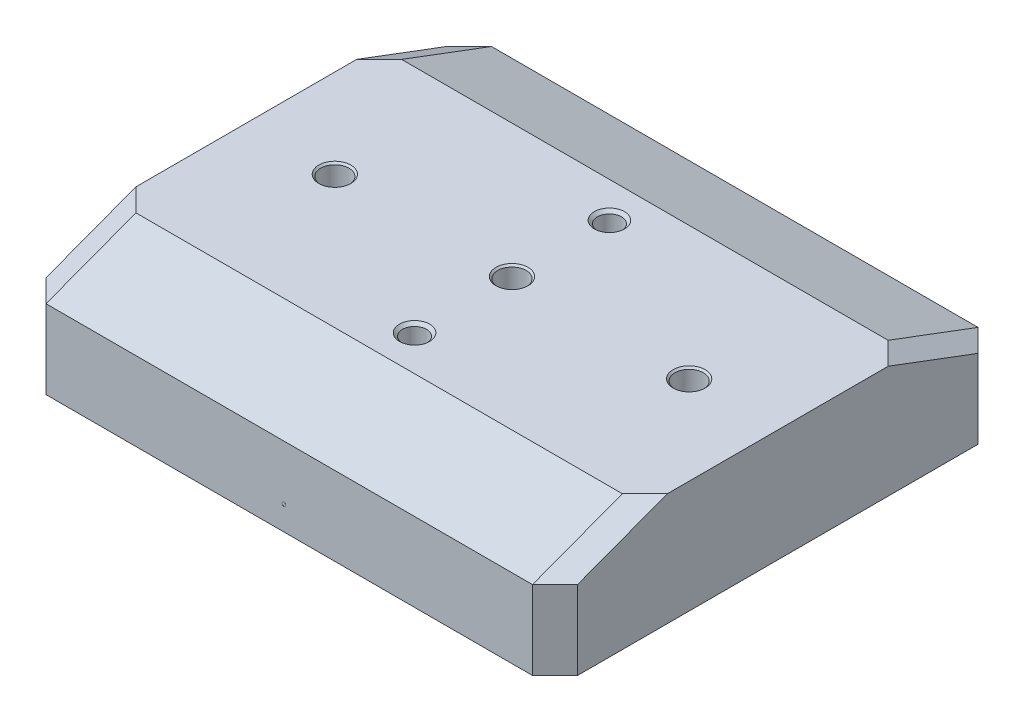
ISO-10303-21;
HEADER;
FILE_DESCRIPTION(('STEP AP214'),'2;1');
FILE_NAME('part.step','',(''),(''),'','','');
FILE_SCHEMA(('AUTOMOTIVE_DESIGN { 1 0 10303 214 1 1 1 1 }'));
ENDSEC;
DATA;
#1=APPLICATION_CONTEXT('core data for automotive mechanical design processes');
#2=APPLICATION_PROTOCOL_DEFINITION('international standard','automotive_design',2000,#1);
#3=PRODUCT_CONTEXT('',#1,'mechanical');
#4=PRODUCT('Part','Part','',(#3));
#5=PRODUCT_RELATED_PRODUCT_CATEGORY('part','',(#4));
#6=PRODUCT_DEFINITION_FORMATION('','',#4);
#7=PRODUCT_DEFINITION_CONTEXT('part definition',#1,'design');
#8=PRODUCT_DEFINITION('design','',#6,#7);
#9=PRODUCT_DEFINITION_SHAPE('','',#8);
#10=(LENGTH_UNIT() NAMED_UNIT(*) SI_UNIT(.MILLI.,.METRE.));
#11=(NAMED_UNIT(*) PLANE_ANGLE_UNIT() SI_UNIT($,.RADIAN.));
#12=(NAMED_UNIT(*) SI_UNIT($,.STERADIAN.) SOLID_ANGLE_UNIT());
#13=UNCERTAINTY_MEASURE_WITH_UNIT(LENGTH_MEASURE(1.E-05),#10,'distance_accuracy_value','');
#14=(GEOMETRIC_REPRESENTATION_CONTEXT(3) GLOBAL_UNCERTAINTY_ASSIGNED_CONTEXT((#13)) GLOBAL_UNIT_ASSIGNED_CONTEXT((#10,
#11,#12)) REPRESENTATION_CONTEXT('',''));
#15=CARTESIAN_POINT('',(0.,0.,0.));
#16=DIRECTION('',(0.,0.,1.));
#17=DIRECTION('',(1.,0.,0.));
#18=AXIS2_PLACEMENT_3D('',#15,#16,#17);
#19=CARTESIAN_POINT('',(75.,31.75,-62.865));
#20=DIRECTION('',(-1.,0.,0.));
#21=DIRECTION('',(0.,0.,1.));
#22=AXIS2_PLACEMENT_3D('',#19,#20,#21);
#23=PLANE('',#22);
#24=DIRECTION('',(0.,1.,0.));
#25=VECTOR('',#24,1.);
#26=CARTESIAN_POINT('',(75.,31.75,-56.515));
#27=LINE('',#26,#25);
#28=CARTESIAN_POINT('',(75.,0.,-56.515));
#29=VERTEX_POINT('',#28);
#30=CARTESIAN_POINT('',(75.,22.225,-56.515));
#31=VERTEX_POINT('',#30);
#32=EDGE_CURVE('E154',#29,#31,#27,.T.);
#33=ORIENTED_EDGE('',*,*,#32,.T.);
#34=DIRECTION('',(0.,0.351548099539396,0.936169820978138));
#35=VECTOR('',#34,1.);
#36=CARTESIAN_POINT('',(75.,21.3123169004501,-58.9454679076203));
#37=LINE('',#36,#35);
#38=CARTESIAN_POINT('',(75.,31.75,-31.15));
#39=VERTEX_POINT('',#38);
#40=EDGE_CURVE('E30',#31,#39,#37,.T.);
#41=ORIENTED_EDGE('',*,*,#40,.T.);
#42=DIRECTION('',(0.,0.,-1.));
#43=VECTOR('',#42,1.);
#44=CARTESIAN_POINT('',(75.,31.75,-62.865));
#45=LINE('',#44,#43);
#46=CARTESIAN_POINT('',(75.,31.75,31.15));
#47=VERTEX_POINT('',#46);
#48=EDGE_CURVE('E216',#47,#39,#45,.T.);
#49=ORIENTED_EDGE('',*,*,#48,.F.);
#50=DIRECTION('',(0.,-0.351548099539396,0.936169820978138));
#51=VECTOR('',#50,1.);
#52=CARTESIAN_POINT('',(75.,62.6911564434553,-51.2460559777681));
#53=LINE('',#52,#51);
#54=CARTESIAN_POINT('',(75.,22.225,56.515));
#55=VERTEX_POINT('',#54);
#56=EDGE_CURVE('E291',#47,#55,#53,.T.);
#57=ORIENTED_EDGE('',*,*,#56,.T.);
#58=DIRECTION('',(0.,-1.,0.));
#59=VECTOR('',#58,1.);
#60=CARTESIAN_POINT('',(75.,31.75,56.515));
#61=LINE('',#60,#59);
#62=CARTESIAN_POINT('',(75.,0.,56.515));
#63=VERTEX_POINT('',#62);
#64=EDGE_CURVE('E152',#55,#63,#61,.T.);
#65=ORIENTED_EDGE('',*,*,#64,.T.);
#66=DIRECTION('',(0.,0.,-1.));
#67=VECTOR('',#66,1.);
#68=CARTESIAN_POINT('',(75.,0.,-62.865));
#69=LINE('',#68,#67);
#70=EDGE_CURVE('E217',#63,#29,#69,.T.);
#71=ORIENTED_EDGE('',*,*,#70,.T.);
#72=EDGE_LOOP('',(#33,#41,#49,#57,#65,#71));
#73=FACE_BOUND('',#72,.T.);
#74=ADVANCED_FACE('F16',(#73),#23,.F.);
#75=CARTESIAN_POINT('',(-75.,31.75,-62.865));
#76=DIRECTION('',(0.,0.,1.));
#77=DIRECTION('',(1.,0.,0.));
#78=AXIS2_PLACEMENT_3D('',#75,#76,#77);
#79=PLANE('',#78);
#80=DIRECTION('',(1.,0.,0.));
#81=VECTOR('',#80,1.);
#82=CARTESIAN_POINT('',(-75.,22.225,-62.865));
#83=LINE('',#82,#81);
#84=CARTESIAN_POINT('',(-68.65,22.225,-62.865));
#85=VERTEX_POINT('',#84);
#86=CARTESIAN_POINT('',(68.65,22.225,-62.865));
#87=VERTEX_POINT('',#86);
#88=EDGE_CURVE('E122',#85,#87,#83,.T.);
#89=ORIENTED_EDGE('',*,*,#88,.T.);
#90=DIRECTION('',(0.,-1.,0.));
#91=VECTOR('',#90,1.);
#92=CARTESIAN_POINT('',(68.65,31.75,-62.865));
#93=LINE('',#92,#91);
#94=CARTESIAN_POINT('',(68.65,0.,-62.865));
#95=VERTEX_POINT('',#94);
#96=EDGE_CURVE('E132',#87,#95,#93,.T.);
#97=ORIENTED_EDGE('',*,*,#96,.T.);
#98=DIRECTION('',(-1.,0.,0.));
#99=VECTOR('',#98,1.);
#100=CARTESIAN_POINT('',(-75.,0.,-62.865));
#101=LINE('',#100,#99);
#102=CARTESIAN_POINT('',(-68.65,0.,-62.865));
#103=VERTEX_POINT('',#102);
#104=EDGE_CURVE('E213',#95,#103,#101,.T.);
#105=ORIENTED_EDGE('',*,*,#104,.T.);
#106=DIRECTION('',(0.,1.,0.));
#107=VECTOR('',#106,1.);
#108=CARTESIAN_POINT('',(-68.65,31.75,-62.865));
#109=LINE('',#108,#107);
#110=EDGE_CURVE('E135',#103,#85,#109,.T.);
#111=ORIENTED_EDGE('',*,*,#110,.T.);
#112=EDGE_LOOP('',(#89,#97,#105,#111));
#113=FACE_BOUND('',#112,.T.);
#114=ADVANCED_FACE('F130',(#113),#79,.F.);
#115=CARTESIAN_POINT('',(-75.,31.75,-62.865));
#116=DIRECTION('',(1.,0.,0.));
#117=DIRECTION('',(0.,0.,-1.));
#118=AXIS2_PLACEMENT_3D('',#115,#116,#117);
#119=PLANE('',#118);
#120=DIRECTION('',(0.,0.,1.));
#121=VECTOR('',#120,1.);
#122=CARTESIAN_POINT('',(-75.,31.75,-62.865));
#123=LINE('',#122,#121);
#124=CARTESIAN_POINT('',(-75.,31.75,-31.15));
#125=VERTEX_POINT('',#124);
#126=CARTESIAN_POINT('',(-75.,31.75,31.15));
#127=VERTEX_POINT('',#126);
#128=EDGE_CURVE('E144',#125,#127,#123,.T.);
#129=ORIENTED_EDGE('',*,*,#128,.F.);
#130=DIRECTION('',(0.,-0.351548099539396,-0.936169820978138));
#131=VECTOR('',#130,1.);
#132=CARTESIAN_POINT('',(-75.,21.3123169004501,-58.9454679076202));
#133=LINE('',#132,#131);
#134=CARTESIAN_POINT('',(-75.,22.225,-56.515));
#135=VERTEX_POINT('',#134);
#136=EDGE_CURVE('E192',#125,#135,#133,.T.);
#137=ORIENTED_EDGE('',*,*,#136,.T.);
#138=DIRECTION('',(0.,-1.,0.));
#139=VECTOR('',#138,1.);
#140=CARTESIAN_POINT('',(-75.,31.75,-56.515));
#141=LINE('',#140,#139);
#142=CARTESIAN_POINT('',(-75.,0.,-56.515));
#143=VERTEX_POINT('',#142);
#144=EDGE_CURVE('E162',#135,#143,#141,.T.);
#145=ORIENTED_EDGE('',*,*,#144,.T.);
#146=DIRECTION('',(0.,0.,1.));
#147=VECTOR('',#146,1.);
#148=CARTESIAN_POINT('',(-75.,0.,-62.865));
#149=LINE('',#148,#147);
#150=CARTESIAN_POINT('',(-75.,0.,56.515));
#151=VERTEX_POINT('',#150);
#152=EDGE_CURVE('E208',#143,#151,#149,.T.);
#153=ORIENTED_EDGE('',*,*,#152,.T.);
#154=DIRECTION('',(0.,1.,0.));
#155=VECTOR('',#154,1.);
#156=CARTESIAN_POINT('',(-75.,31.75,56.515));
#157=LINE('',#156,#155);
#158=CARTESIAN_POINT('',(-75.,22.225,56.515));
#159=VERTEX_POINT('',#158);
#160=EDGE_CURVE('E164',#151,#159,#157,.T.);
#161=ORIENTED_EDGE('',*,*,#160,.T.);
#162=DIRECTION('',(0.,0.351548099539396,-0.936169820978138));
#163=VECTOR('',#162,1.);
#164=CARTESIAN_POINT('',(-75.,62.6911564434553,-51.2460559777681));
#165=LINE('',#164,#163);
#166=EDGE_CURVE('E38',#159,#127,#165,.T.);
#167=ORIENTED_EDGE('',*,*,#166,.T.);
#168=EDGE_LOOP('',(#129,#137,#145,#153,#161,#167));
#169=FACE_BOUND('',#168,.T.);
#170=ADVANCED_FACE('F199',(#169),#119,.F.);
#171=CARTESIAN_POINT('',(-75.,31.75,62.865));
#172=DIRECTION('',(0.,0.,-1.));
#173=DIRECTION('',(-1.,0.,0.));
#174=AXIS2_PLACEMENT_3D('',#171,#172,#173);
#175=PLANE('',#174);
#176=CARTESIAN_POINT('',(-1.5407849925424,6.79498270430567,62.865));
#177=DIRECTION('',(0.,0.,1.));
#178=DIRECTION('',(1.,0.,0.));
#179=AXIS2_PLACEMENT_3D('',#176,#177,#178);
#180=CIRCLE('',#179,0.546700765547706);
#181=CARTESIAN_POINT('',(-0.994084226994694,6.79498270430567,62.865));
#182=VERTEX_POINT('',#181);
#183=EDGE_CURVE('E282',#182,#182,#180,.T.);
#184=ORIENTED_EDGE('',*,*,#183,.F.);
#185=EDGE_LOOP('',(#184));
#186=FACE_BOUND('',#185,.T.);
#187=DIRECTION('',(1.,0.,0.));
#188=VECTOR('',#187,1.);
#189=CARTESIAN_POINT('',(-75.,0.,62.865));
#190=LINE('',#189,#188);
#191=CARTESIAN_POINT('',(-68.65,0.,62.865));
#192=VERTEX_POINT('',#191);
#193=CARTESIAN_POINT('',(68.65,0.,62.865));
#194=VERTEX_POINT('',#193);
#195=EDGE_CURVE('E212',#192,#194,#190,.T.);
#196=ORIENTED_EDGE('',*,*,#195,.T.);
#197=DIRECTION('',(0.,1.,0.));
#198=VECTOR('',#197,1.);
#199=CARTESIAN_POINT('',(68.65,31.75,62.865));
#200=LINE('',#199,#198);
#201=CARTESIAN_POINT('',(68.65,22.225,62.865));
#202=VERTEX_POINT('',#201);
#203=EDGE_CURVE('E159',#194,#202,#200,.T.);
#204=ORIENTED_EDGE('',*,*,#203,.T.);
#205=DIRECTION('',(1.,0.,0.));
#206=VECTOR('',#205,1.);
#207=CARTESIAN_POINT('',(-75.,22.225,62.865));
#208=LINE('',#207,#206);
#209=CARTESIAN_POINT('',(-68.65,22.225,62.865));
#210=VERTEX_POINT('',#209);
#211=EDGE_CURVE('E136',#210,#202,#208,.T.);
#212=ORIENTED_EDGE('',*,*,#211,.F.);
#213=DIRECTION('',(0.,-1.,0.));
#214=VECTOR('',#213,1.);
#215=CARTESIAN_POINT('',(-68.65,31.75,62.865));
#216=LINE('',#215,#214);
#217=EDGE_CURVE('E156',#210,#192,#216,.T.);
#218=ORIENTED_EDGE('',*,*,#217,.T.);
#219=EDGE_LOOP('',(#196,#204,#212,#218));
#220=FACE_BOUND('',#219,.T.);
#221=ADVANCED_FACE('F326',(#186,#220),#175,.F.);
#222=CARTESIAN_POINT('',(0.,31.75,0.));
#223=DIRECTION('',(0.,1.,0.));
#224=DIRECTION('',(0.,0.,1.));
#225=AXIS2_PLACEMENT_3D('',#222,#223,#224);
#226=PLANE('',#225);
#227=DIRECTION('',(0.707106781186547,0.,0.707106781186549));
#228=VECTOR('',#227,1.);
#229=CARTESIAN_POINT('',(53.075,31.75,-53.075));
#230=LINE('',#229,#228);
#231=CARTESIAN_POINT('',(68.65,31.75,-37.5));
#232=VERTEX_POINT('',#231);
#233=EDGE_CURVE('E125',#232,#39,#230,.T.);
#234=ORIENTED_EDGE('',*,*,#233,.F.);
#235=DIRECTION('',(1.,0.,0.));
#236=VECTOR('',#235,1.);
#237=CARTESIAN_POINT('',(-75.,31.75,-37.5));
#238=LINE('',#237,#236);
#239=CARTESIAN_POINT('',(-68.65,31.75,-37.5));
#240=VERTEX_POINT('',#239);
#241=EDGE_CURVE('E124',#240,#232,#238,.T.);
#242=ORIENTED_EDGE('',*,*,#241,.F.);
#243=DIRECTION('',(0.707106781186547,0.,-0.707106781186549));
#244=VECTOR('',#243,1.);
#245=CARTESIAN_POINT('',(-53.075,31.75,-53.075));
#246=LINE('',#245,#244);
#247=EDGE_CURVE('E203',#125,#240,#246,.T.);
#248=ORIENTED_EDGE('',*,*,#247,.F.);
#249=ORIENTED_EDGE('',*,*,#128,.T.);
#250=DIRECTION('',(-0.707106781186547,0.,-0.707106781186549));
#251=VECTOR('',#250,1.);
#252=CARTESIAN_POINT('',(-53.075,31.75,53.075));
#253=LINE('',#252,#251);
#254=CARTESIAN_POINT('',(-68.65,31.75,37.5));
#255=VERTEX_POINT('',#254);
#256=EDGE_CURVE('E303',#255,#127,#253,.T.);
#257=ORIENTED_EDGE('',*,*,#256,.F.);
#258=DIRECTION('',(1.,0.,0.));
#259=VECTOR('',#258,1.);
#260=CARTESIAN_POINT('',(-75.,31.75,37.5));
#261=LINE('',#260,#259);
#262=CARTESIAN_POINT('',(68.65,31.75,37.5));
#263=VERTEX_POINT('',#262);
#264=EDGE_CURVE('E236',#255,#263,#261,.T.);
#265=ORIENTED_EDGE('',*,*,#264,.T.);
#266=DIRECTION('',(-0.707106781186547,0.,0.707106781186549));
#267=VECTOR('',#266,1.);
#268=CARTESIAN_POINT('',(53.075,31.75,53.075));
#269=LINE('',#268,#267);
#270=EDGE_CURVE('E296',#47,#263,#269,.T.);
#271=ORIENTED_EDGE('',*,*,#270,.F.);
#272=ORIENTED_EDGE('',*,*,#48,.T.);
#273=EDGE_LOOP('',(#234,#242,#248,#249,#257,#265,#271,#272));
#274=FACE_BOUND('',#273,.T.);
#275=CARTESIAN_POINT('',(-50.,31.75,0.));
#276=DIRECTION('',(0.,1.,0.));
#277=DIRECTION('',(0.,0.,1.));
#278=AXIS2_PLACEMENT_3D('',#275,#276,#277);
#279=CIRCLE('',#278,4.51993);
#280=CARTESIAN_POINT('',(-50.,31.75,4.51993));
#281=VERTEX_POINT('',#280);
#282=EDGE_CURVE('E173',#281,#281,#279,.F.);
#283=ORIENTED_EDGE('',*,*,#282,.T.);
#284=EDGE_LOOP('',(#283));
#285=FACE_BOUND('',#284,.T.);
#286=CARTESIAN_POINT('',(50.,31.75,0.));
#287=DIRECTION('',(0.,1.,0.));
#288=DIRECTION('',(0.,0.,1.));
#289=AXIS2_PLACEMENT_3D('',#286,#287,#288);
#290=CIRCLE('',#289,4.51993);
#291=CARTESIAN_POINT('',(50.,31.75,4.51993));
#292=VERTEX_POINT('',#291);
#293=EDGE_CURVE('E170',#292,#292,#290,.F.);
#294=ORIENTED_EDGE('',*,*,#293,.T.);
#295=EDGE_LOOP('',(#294));
#296=FACE_BOUND('',#295,.T.);
#297=CARTESIAN_POINT('',(0.,31.75,0.));
#298=DIRECTION('',(0.,1.,0.));
#299=DIRECTION('',(0.,0.,1.));
#300=AXIS2_PLACEMENT_3D('',#297,#298,#299);
#301=CIRCLE('',#300,4.51993);
#302=CARTESIAN_POINT('',(0.,31.75,4.51993));
#303=VERTEX_POINT('',#302);
#304=EDGE_CURVE('E167',#303,#303,#301,.F.);
#305=ORIENTED_EDGE('',*,*,#304,.T.);
#306=EDGE_LOOP('',(#305));
#307=FACE_BOUND('',#306,.T.);
#308=CARTESIAN_POINT('',(0.,31.75,-27.499999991));
#309=DIRECTION('',(0.,1.,0.));
#310=DIRECTION('',(0.,0.,1.));
#311=AXIS2_PLACEMENT_3D('',#308,#309,#310);
#312=CIRCLE('',#311,4.25);
#313=CARTESIAN_POINT('',(0.,31.75,-23.249999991));
#314=VERTEX_POINT('',#313);
#315=EDGE_CURVE('E269',#314,#314,#312,.T.);
#316=ORIENTED_EDGE('',*,*,#315,.F.);
#317=EDGE_LOOP('',(#316));
#318=FACE_BOUND('',#317,.T.);
#319=CARTESIAN_POINT('',(0.,31.75,27.499999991));
#320=DIRECTION('',(0.,1.,0.));
#321=DIRECTION('',(0.,0.,1.));
#322=AXIS2_PLACEMENT_3D('',#319,#320,#321);
#323=CIRCLE('',#322,4.25);
#324=CARTESIAN_POINT('',(0.,31.75,31.749999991));
#325=VERTEX_POINT('',#324);
#326=EDGE_CURVE('E260',#325,#325,#323,.T.);
#327=ORIENTED_EDGE('',*,*,#326,.F.);
#328=EDGE_LOOP('',(#327));
#329=FACE_BOUND('',#328,.T.);
#330=ADVANCED_FACE('F314',(#274,#285,#296,#307,#318,#329),#226,.T.);
#331=CARTESIAN_POINT('',(0.,0.,0.));
#332=DIRECTION('',(0.,1.,0.));
#333=DIRECTION('',(0.,0.,1.));
#334=AXIS2_PLACEMENT_3D('',#331,#332,#333);
#335=PLANE('',#334);
#336=CARTESIAN_POINT('',(48.,0.,48.));
#337=DIRECTION('',(0.,-1.,0.));
#338=DIRECTION('',(0.,0.,1.));
#339=AXIS2_PLACEMENT_3D('',#336,#337,#338);
#340=CIRCLE('',#339,8.00989);
#341=CARTESIAN_POINT('',(48.,0.,56.00989));
#342=VERTEX_POINT('',#341);
#343=EDGE_CURVE('E245',#342,#342,#340,.T.);
#344=ORIENTED_EDGE('',*,*,#343,.F.);
#345=EDGE_LOOP('',(#344));
#346=FACE_BOUND('',#345,.T.);
#347=CARTESIAN_POINT('',(-48.,0.,-48.));
#348=DIRECTION('',(0.,-1.,0.));
#349=DIRECTION('',(0.,0.,1.));
#350=AXIS2_PLACEMENT_3D('',#347,#348,#349);
#351=CIRCLE('',#350,8.00989);
#352=CARTESIAN_POINT('',(-48.,0.,-39.99011));
#353=VERTEX_POINT('',#352);
#354=EDGE_CURVE('E239',#353,#353,#351,.T.);
#355=ORIENTED_EDGE('',*,*,#354,.F.);
#356=EDGE_LOOP('',(#355));
#357=FACE_BOUND('',#356,.T.);
#358=CARTESIAN_POINT('',(48.,0.,-48.));
#359=DIRECTION('',(0.,-1.,0.));
#360=DIRECTION('',(0.,0.,-1.));
#361=AXIS2_PLACEMENT_3D('',#358,#359,#360);
#362=CIRCLE('',#361,8.00989);
#363=CARTESIAN_POINT('',(48.,0.,-56.00989));
#364=VERTEX_POINT('',#363);
#365=EDGE_CURVE('E232',#364,#364,#362,.T.);
#366=ORIENTED_EDGE('',*,*,#365,.F.);
#367=EDGE_LOOP('',(#366));
#368=FACE_BOUND('',#367,.T.);
#369=CARTESIAN_POINT('',(-48.,0.,48.));
#370=DIRECTION('',(0.,-1.,0.));
#371=DIRECTION('',(0.,0.,-1.));
#372=AXIS2_PLACEMENT_3D('',#369,#370,#371);
#373=CIRCLE('',#372,8.00989);
#374=CARTESIAN_POINT('',(-48.,0.,39.99011));
#375=VERTEX_POINT('',#374);
#376=EDGE_CURVE('E226',#375,#375,#373,.T.);
#377=ORIENTED_EDGE('',*,*,#376,.F.);
#378=EDGE_LOOP('',(#377));
#379=FACE_BOUND('',#378,.T.);
#380=ORIENTED_EDGE('',*,*,#104,.F.);
#381=DIRECTION('',(-0.707106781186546,0.,-0.707106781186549));
#382=VECTOR('',#381,1.);
#383=CARTESIAN_POINT('',(68.65,0.,-62.865));
#384=LINE('',#383,#382);
#385=EDGE_CURVE('E139',#95,#29,#384,.F.);
#386=ORIENTED_EDGE('',*,*,#385,.T.);
#387=ORIENTED_EDGE('',*,*,#70,.F.);
#388=DIRECTION('',(0.70710678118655,0.,-0.707106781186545));
#389=VECTOR('',#388,1.);
#390=CARTESIAN_POINT('',(75.,0.,56.515));
#391=LINE('',#390,#389);
#392=EDGE_CURVE('E149',#63,#194,#391,.F.);
#393=ORIENTED_EDGE('',*,*,#392,.T.);
#394=ORIENTED_EDGE('',*,*,#195,.F.);
#395=DIRECTION('',(0.707106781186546,0.,0.707106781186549));
#396=VECTOR('',#395,1.);
#397=CARTESIAN_POINT('',(-68.65,0.,62.865));
#398=LINE('',#397,#396);
#399=EDGE_CURVE('E142',#192,#151,#398,.F.);
#400=ORIENTED_EDGE('',*,*,#399,.T.);
#401=ORIENTED_EDGE('',*,*,#152,.F.);
#402=DIRECTION('',(-0.707106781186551,0.,0.707106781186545));
#403=VECTOR('',#402,1.);
#404=CARTESIAN_POINT('',(-75.,0.,-56.515));
#405=LINE('',#404,#403);
#406=EDGE_CURVE('E140',#143,#103,#405,.F.);
#407=ORIENTED_EDGE('',*,*,#406,.T.);
#408=EDGE_LOOP('',(#380,#386,#387,#393,#394,#400,#401,#407));
#409=FACE_BOUND('',#408,.T.);
#410=ADVANCED_FACE('F209',(#346,#357,#368,#379,#409),#335,.F.);
#411=CARTESIAN_POINT('',(-48.,5.9944,48.));
#412=DIRECTION('',(0.,-1.,0.));
#413=DIRECTION('',(0.,0.,-1.));
#414=AXIS2_PLACEMENT_3D('',#411,#412,#413);
#415=CYLINDRICAL_SURFACE('',#414,8.00989);
#416=CARTESIAN_POINT('',(-48.,5.9944,48.));
#417=DIRECTION('',(0.,-1.,0.));
#418=DIRECTION('',(0.,0.,-1.));
#419=AXIS2_PLACEMENT_3D('',#416,#417,#418);
#420=CIRCLE('',#419,8.00989);
#421=CARTESIAN_POINT('',(-48.,5.9944,39.99011));
#422=VERTEX_POINT('',#421);
#423=EDGE_CURVE('E222',#422,#422,#420,.T.);
#424=ORIENTED_EDGE('',*,*,#423,.F.);
#425=EDGE_LOOP('',(#424));
#426=FACE_BOUND('',#425,.T.);
#427=ORIENTED_EDGE('',*,*,#376,.T.);
#428=EDGE_LOOP('',(#427));
#429=FACE_BOUND('',#428,.T.);
#430=ADVANCED_FACE('F455',(#426,#429),#415,.F.);
#431=CARTESIAN_POINT('',(-48.,5.9944,48.));
#432=DIRECTION('',(0.,-1.,0.));
#433=DIRECTION('',(0.,0.,-1.));
#434=AXIS2_PLACEMENT_3D('',#431,#432,#433);
#435=PLANE('',#434);
#436=ORIENTED_EDGE('',*,*,#423,.T.);
#437=EDGE_LOOP('',(#436));
#438=FACE_BOUND('',#437,.T.);
#439=ADVANCED_FACE('F451',(#438),#435,.T.);
#440=CARTESIAN_POINT('',(48.,5.9944,-48.));
#441=DIRECTION('',(0.,-1.,0.));
#442=DIRECTION('',(0.,0.,-1.));
#443=AXIS2_PLACEMENT_3D('',#440,#441,#442);
#444=CYLINDRICAL_SURFACE('',#443,8.00989);
#445=CARTESIAN_POINT('',(48.,5.9944,-48.));
#446=DIRECTION('',(0.,-1.,0.));
#447=DIRECTION('',(0.,0.,-1.));
#448=AXIS2_PLACEMENT_3D('',#445,#446,#447);
#449=CIRCLE('',#448,8.00989);
#450=CARTESIAN_POINT('',(48.,5.9944,-56.00989));
#451=VERTEX_POINT('',#450);
#452=EDGE_CURVE('E235',#451,#451,#449,.T.);
#453=ORIENTED_EDGE('',*,*,#452,.F.);
#454=EDGE_LOOP('',(#453));
#455=FACE_BOUND('',#454,.T.);
#456=ORIENTED_EDGE('',*,*,#365,.T.);
#457=EDGE_LOOP('',(#456));
#458=FACE_BOUND('',#457,.T.);
#459=ADVANCED_FACE('F447',(#455,#458),#444,.F.);
#460=CARTESIAN_POINT('',(48.,5.9944,-48.));
#461=DIRECTION('',(0.,-1.,0.));
#462=DIRECTION('',(0.,0.,-1.));
#463=AXIS2_PLACEMENT_3D('',#460,#461,#462);
#464=PLANE('',#463);
#465=ORIENTED_EDGE('',*,*,#452,.T.);
#466=EDGE_LOOP('',(#465));
#467=FACE_BOUND('',#466,.T.);
#468=ADVANCED_FACE('F443',(#467),#464,.T.);
#469=CARTESIAN_POINT('',(-48.,5.9944,-48.));
#470=DIRECTION('',(0.,-1.,0.));
#471=DIRECTION('',(0.,0.,-1.));
#472=AXIS2_PLACEMENT_3D('',#469,#470,#471);
#473=CYLINDRICAL_SURFACE('',#472,8.00989);
#474=CARTESIAN_POINT('',(-48.,5.9944,-48.));
#475=DIRECTION('',(0.,-1.,0.));
#476=DIRECTION('',(0.,0.,1.));
#477=AXIS2_PLACEMENT_3D('',#474,#475,#476);
#478=CIRCLE('',#477,8.00989);
#479=CARTESIAN_POINT('',(-48.,5.9944,-39.99011));
#480=VERTEX_POINT('',#479);
#481=EDGE_CURVE('E242',#480,#480,#478,.T.);
#482=ORIENTED_EDGE('',*,*,#481,.F.);
#483=EDGE_LOOP('',(#482));
#484=FACE_BOUND('',#483,.T.);
#485=ORIENTED_EDGE('',*,*,#354,.T.);
#486=EDGE_LOOP('',(#485));
#487=FACE_BOUND('',#486,.T.);
#488=ADVANCED_FACE('F439',(#484,#487),#473,.F.);
#489=CARTESIAN_POINT('',(-48.,5.9944,-48.));
#490=DIRECTION('',(0.,1.,0.));
#491=DIRECTION('',(0.,0.,1.));
#492=AXIS2_PLACEMENT_3D('',#489,#490,#491);
#493=PLANE('',#492);
#494=ORIENTED_EDGE('',*,*,#481,.T.);
#495=EDGE_LOOP('',(#494));
#496=FACE_BOUND('',#495,.T.);
#497=ADVANCED_FACE('F435',(#496),#493,.F.);
#498=CARTESIAN_POINT('',(48.,5.9944,48.));
#499=DIRECTION('',(0.,-1.,0.));
#500=DIRECTION('',(0.,0.,-1.));
#501=AXIS2_PLACEMENT_3D('',#498,#499,#500);
#502=CYLINDRICAL_SURFACE('',#501,8.00989);
#503=CARTESIAN_POINT('',(48.,5.9944,48.));
#504=DIRECTION('',(0.,-1.,0.));
#505=DIRECTION('',(0.,0.,1.));
#506=AXIS2_PLACEMENT_3D('',#503,#504,#505);
#507=CIRCLE('',#506,8.00989);
#508=CARTESIAN_POINT('',(48.,5.9944,56.00989));
#509=VERTEX_POINT('',#508);
#510=EDGE_CURVE('E229',#509,#509,#507,.T.);
#511=ORIENTED_EDGE('',*,*,#510,.F.);
#512=EDGE_LOOP('',(#511));
#513=FACE_BOUND('',#512,.T.);
#514=ORIENTED_EDGE('',*,*,#343,.T.);
#515=EDGE_LOOP('',(#514));
#516=FACE_BOUND('',#515,.T.);
#517=ADVANCED_FACE('F431',(#513,#516),#502,.F.);
#518=CARTESIAN_POINT('',(48.,5.9944,48.));
#519=DIRECTION('',(0.,1.,0.));
#520=DIRECTION('',(0.,0.,1.));
#521=AXIS2_PLACEMENT_3D('',#518,#519,#520);
#522=PLANE('',#521);
#523=ORIENTED_EDGE('',*,*,#510,.T.);
#524=EDGE_LOOP('',(#523));
#525=FACE_BOUND('',#524,.T.);
#526=ADVANCED_FACE('F428',(#525),#522,.F.);
#527=CARTESIAN_POINT('',(-75.,22.225,62.865));
#528=DIRECTION('',(0.,-0.936169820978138,-0.351548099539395));
#529=DIRECTION('',(0.,0.351548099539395,-0.936169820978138));
#530=AXIS2_PLACEMENT_3D('',#527,#528,#529);
#531=PLANE('',#530);
#532=ORIENTED_EDGE('',*,*,#264,.F.);
#533=DIRECTION('',(0.,-0.351548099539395,0.936169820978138));
#534=VECTOR('',#533,1.);
#535=CARTESIAN_POINT('',(-68.65,22.225,62.865));
#536=LINE('',#535,#534);
#537=EDGE_CURVE('E202',#255,#210,#536,.T.);
#538=ORIENTED_EDGE('',*,*,#537,.T.);
#539=ORIENTED_EDGE('',*,*,#211,.T.);
#540=DIRECTION('',(0.,0.351548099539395,-0.936169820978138));
#541=VECTOR('',#540,1.);
#542=CARTESIAN_POINT('',(68.65,22.225,62.865));
#543=LINE('',#542,#541);
#544=EDGE_CURVE('E299',#202,#263,#543,.T.);
#545=ORIENTED_EDGE('',*,*,#544,.T.);
#546=EDGE_LOOP('',(#532,#538,#539,#545));
#547=FACE_BOUND('',#546,.T.);
#548=ADVANCED_FACE('F322',(#547),#531,.F.);
#549=CARTESIAN_POINT('',(-75.,22.225,-62.865));
#550=DIRECTION('',(0.,-0.936169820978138,0.351548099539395));
#551=DIRECTION('',(0.,-0.351548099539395,-0.936169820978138));
#552=AXIS2_PLACEMENT_3D('',#549,#550,#551);
#553=PLANE('',#552);
#554=ORIENTED_EDGE('',*,*,#241,.T.);
#555=DIRECTION('',(0.,-0.351548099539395,-0.936169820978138));
#556=VECTOR('',#555,1.);
#557=CARTESIAN_POINT('',(68.65,22.225,-62.865));
#558=LINE('',#557,#556);
#559=EDGE_CURVE('E110',#232,#87,#558,.T.);
#560=ORIENTED_EDGE('',*,*,#559,.T.);
#561=ORIENTED_EDGE('',*,*,#88,.F.);
#562=DIRECTION('',(0.,0.351548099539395,0.936169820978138));
#563=VECTOR('',#562,1.);
#564=CARTESIAN_POINT('',(-68.65,22.225,-62.865));
#565=LINE('',#564,#563);
#566=EDGE_CURVE('E194',#85,#240,#565,.T.);
#567=ORIENTED_EDGE('',*,*,#566,.T.);
#568=EDGE_LOOP('',(#554,#560,#561,#567));
#569=FACE_BOUND('',#568,.T.);
#570=ADVANCED_FACE('F120',(#569),#553,.F.);
#571=CARTESIAN_POINT('',(68.65,31.75,-62.865));
#572=DIRECTION('',(-0.707106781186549,0.,0.707106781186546));
#573=DIRECTION('',(0.,-1.,0.));
#574=AXIS2_PLACEMENT_3D('',#571,#572,#573);
#575=PLANE('',#574);
#576=DIRECTION('',(0.707106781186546,0.,0.707106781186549));
#577=VECTOR('',#576,1.);
#578=CARTESIAN_POINT('',(68.65,22.225,-62.865));
#579=LINE('',#578,#577);
#580=EDGE_CURVE('E11',#31,#87,#579,.F.);
#581=ORIENTED_EDGE('',*,*,#580,.F.);
#582=ORIENTED_EDGE('',*,*,#32,.F.);
#583=ORIENTED_EDGE('',*,*,#385,.F.);
#584=ORIENTED_EDGE('',*,*,#96,.F.);
#585=EDGE_LOOP('',(#581,#582,#583,#584));
#586=FACE_BOUND('',#585,.T.);
#587=ADVANCED_FACE('F138',(#586),#575,.F.);
#588=CARTESIAN_POINT('',(75.,31.75,56.515));
#589=DIRECTION('',(-0.707106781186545,0.,-0.70710678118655));
#590=DIRECTION('',(0.,-1.,0.));
#591=AXIS2_PLACEMENT_3D('',#588,#589,#590);
#592=PLANE('',#591);
#593=DIRECTION('',(-0.70710678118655,0.,0.707106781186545));
#594=VECTOR('',#593,1.);
#595=CARTESIAN_POINT('',(75.,22.225,56.515));
#596=LINE('',#595,#594);
#597=EDGE_CURVE('E185',#202,#55,#596,.F.);
#598=ORIENTED_EDGE('',*,*,#597,.F.);
#599=ORIENTED_EDGE('',*,*,#203,.F.);
#600=ORIENTED_EDGE('',*,*,#392,.F.);
#601=ORIENTED_EDGE('',*,*,#64,.F.);
#602=EDGE_LOOP('',(#598,#599,#600,#601));
#603=FACE_BOUND('',#602,.T.);
#604=ADVANCED_FACE('F351',(#603),#592,.F.);
#605=CARTESIAN_POINT('',(-68.65,31.75,62.865));
#606=DIRECTION('',(0.707106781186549,0.,-0.707106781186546));
#607=DIRECTION('',(0.,-1.,0.));
#608=AXIS2_PLACEMENT_3D('',#605,#606,#607);
#609=PLANE('',#608);
#610=DIRECTION('',(-0.707106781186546,0.,-0.707106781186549));
#611=VECTOR('',#610,1.);
#612=CARTESIAN_POINT('',(-68.65,22.225,62.865));
#613=LINE('',#612,#611);
#614=EDGE_CURVE('E187',#159,#210,#613,.F.);
#615=ORIENTED_EDGE('',*,*,#614,.F.);
#616=ORIENTED_EDGE('',*,*,#160,.F.);
#617=ORIENTED_EDGE('',*,*,#399,.F.);
#618=ORIENTED_EDGE('',*,*,#217,.F.);
#619=EDGE_LOOP('',(#615,#616,#617,#618));
#620=FACE_BOUND('',#619,.T.);
#621=ADVANCED_FACE('F329',(#620),#609,.F.);
#622=CARTESIAN_POINT('',(-75.,31.75,-56.515));
#623=DIRECTION('',(0.707106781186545,0.,0.707106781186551));
#624=DIRECTION('',(0.,-1.,0.));
#625=AXIS2_PLACEMENT_3D('',#622,#623,#624);
#626=PLANE('',#625);
#627=DIRECTION('',(0.707106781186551,0.,-0.707106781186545));
#628=VECTOR('',#627,1.);
#629=CARTESIAN_POINT('',(-75.,22.225,-56.515));
#630=LINE('',#629,#628);
#631=EDGE_CURVE('E24',#85,#135,#630,.F.);
#632=ORIENTED_EDGE('',*,*,#631,.F.);
#633=ORIENTED_EDGE('',*,*,#110,.F.);
#634=ORIENTED_EDGE('',*,*,#406,.F.);
#635=ORIENTED_EDGE('',*,*,#144,.F.);
#636=EDGE_LOOP('',(#632,#633,#634,#635));
#637=FACE_BOUND('',#636,.T.);
#638=ADVANCED_FACE('F205',(#637),#626,.F.);
#639=CARTESIAN_POINT('',(0.,11.938,27.499999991));
#640=DIRECTION('',(0.,1.,0.));
#641=DIRECTION('',(0.,0.,1.));
#642=AXIS2_PLACEMENT_3D('',#639,#640,#641);
#643=CONICAL_SURFACE('',#642,3.4,1.02974425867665);
#644=CARTESIAN_POINT('',(0.,9.89507389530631,27.499999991));
#645=VERTEX_POINT('',#644);
#646=VERTEX_LOOP('',#645);
#647=FACE_BOUND('',#646,.T.);
#648=CARTESIAN_POINT('',(0.,11.938,27.499999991));
#649=DIRECTION('',(0.,1.,0.));
#650=DIRECTION('',(0.,0.,1.));
#651=AXIS2_PLACEMENT_3D('',#648,#649,#650);
#652=CIRCLE('',#651,3.4);
#653=CARTESIAN_POINT('',(0.,11.938,30.899999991));
#654=VERTEX_POINT('',#653);
#655=EDGE_CURVE('E253',#654,#654,#652,.T.);
#656=ORIENTED_EDGE('',*,*,#655,.T.);
#657=EDGE_LOOP('',(#656));
#658=FACE_BOUND('',#657,.T.);
#659=ADVANCED_FACE('F359',(#647,#658),#643,.F.);
#660=CARTESIAN_POINT('',(0.,31.75,27.499999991));
#661=DIRECTION('',(0.,1.,0.));
#662=DIRECTION('',(0.,0.,1.));
#663=AXIS2_PLACEMENT_3D('',#660,#661,#662);
#664=CYLINDRICAL_SURFACE('',#663,3.4);
#665=ORIENTED_EDGE('',*,*,#655,.F.);
#666=EDGE_LOOP('',(#665));
#667=FACE_BOUND('',#666,.T.);
#668=CARTESIAN_POINT('',(0.,30.9,27.499999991));
#669=DIRECTION('',(0.,1.,0.));
#670=DIRECTION('',(0.,0.,1.));
#671=AXIS2_PLACEMENT_3D('',#668,#669,#670);
#672=CIRCLE('',#671,3.4);
#673=CARTESIAN_POINT('',(0.,30.9,30.899999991));
#674=VERTEX_POINT('',#673);
#675=EDGE_CURVE('E257',#674,#674,#672,.T.);
#676=ORIENTED_EDGE('',*,*,#675,.T.);
#677=EDGE_LOOP('',(#676));
#678=FACE_BOUND('',#677,.T.);
#679=ADVANCED_FACE('F416',(#667,#678),#664,.F.);
#680=CARTESIAN_POINT('',(0.,31.75,27.499999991));
#681=DIRECTION('',(0.,1.,0.));
#682=DIRECTION('',(0.,0.,1.));
#683=AXIS2_PLACEMENT_3D('',#680,#681,#682);
#684=CONICAL_SURFACE('',#683,4.25,0.785398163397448);
#685=ORIENTED_EDGE('',*,*,#675,.F.);
#686=EDGE_LOOP('',(#685));
#687=FACE_BOUND('',#686,.T.);
#688=ORIENTED_EDGE('',*,*,#326,.T.);
#689=EDGE_LOOP('',(#688));
#690=FACE_BOUND('',#689,.T.);
#691=ADVANCED_FACE('F412',(#687,#690),#684,.F.);
#692=CARTESIAN_POINT('',(0.,11.938,-27.499999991));
#693=DIRECTION('',(0.,1.,0.));
#694=DIRECTION('',(0.,0.,1.));
#695=AXIS2_PLACEMENT_3D('',#692,#693,#694);
#696=CONICAL_SURFACE('',#695,3.4,1.02974425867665);
#697=CARTESIAN_POINT('',(0.,9.89507389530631,-27.499999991));
#698=VERTEX_POINT('',#697);
#699=VERTEX_LOOP('',#698);
#700=FACE_BOUND('',#699,.T.);
#701=CARTESIAN_POINT('',(0.,11.938,-27.499999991));
#702=DIRECTION('',(0.,1.,0.));
#703=DIRECTION('',(0.,0.,1.));
#704=AXIS2_PLACEMENT_3D('',#701,#702,#703);
#705=CIRCLE('',#704,3.4);
#706=CARTESIAN_POINT('',(0.,11.938,-24.099999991));
#707=VERTEX_POINT('',#706);
#708=EDGE_CURVE('E263',#707,#707,#705,.T.);
#709=ORIENTED_EDGE('',*,*,#708,.T.);
#710=EDGE_LOOP('',(#709));
#711=FACE_BOUND('',#710,.T.);
#712=ADVANCED_FACE('F408',(#700,#711),#696,.F.);
#713=CARTESIAN_POINT('',(0.,31.75,-27.499999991));
#714=DIRECTION('',(0.,1.,0.));
#715=DIRECTION('',(0.,0.,1.));
#716=AXIS2_PLACEMENT_3D('',#713,#714,#715);
#717=CYLINDRICAL_SURFACE('',#716,3.4);
#718=ORIENTED_EDGE('',*,*,#708,.F.);
#719=EDGE_LOOP('',(#718));
#720=FACE_BOUND('',#719,.T.);
#721=CARTESIAN_POINT('',(0.,30.9,-27.499999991));
#722=DIRECTION('',(0.,1.,0.));
#723=DIRECTION('',(0.,0.,1.));
#724=AXIS2_PLACEMENT_3D('',#721,#722,#723);
#725=CIRCLE('',#724,3.4);
#726=CARTESIAN_POINT('',(0.,30.9,-24.099999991));
#727=VERTEX_POINT('',#726);
#728=EDGE_CURVE('E266',#727,#727,#725,.T.);
#729=ORIENTED_EDGE('',*,*,#728,.T.);
#730=EDGE_LOOP('',(#729));
#731=FACE_BOUND('',#730,.T.);
#732=ADVANCED_FACE('F404',(#720,#731),#717,.F.);
#733=CARTESIAN_POINT('',(0.,31.75,-27.499999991));
#734=DIRECTION('',(0.,1.,0.));
#735=DIRECTION('',(0.,0.,1.));
#736=AXIS2_PLACEMENT_3D('',#733,#734,#735);
#737=CONICAL_SURFACE('',#736,4.25,0.785398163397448);
#738=ORIENTED_EDGE('',*,*,#728,.F.);
#739=EDGE_LOOP('',(#738));
#740=FACE_BOUND('',#739,.T.);
#741=ORIENTED_EDGE('',*,*,#315,.T.);
#742=EDGE_LOOP('',(#741));
#743=FACE_BOUND('',#742,.T.);
#744=ADVANCED_FACE('F400',(#740,#743),#737,.F.);
#745=CARTESIAN_POINT('',(0.,20.32,0.));
#746=DIRECTION('',(0.,1.,0.));
#747=DIRECTION('',(0.,0.,1.));
#748=AXIS2_PLACEMENT_3D('',#745,#746,#747);
#749=CYLINDRICAL_SURFACE('',#748,4.01193);
#750=CARTESIAN_POINT('',(0.,31.242,0.));
#751=DIRECTION('',(0.,1.,0.));
#752=DIRECTION('',(0.,0.,1.));
#753=AXIS2_PLACEMENT_3D('',#750,#751,#752);
#754=CIRCLE('',#753,4.01193);
#755=CARTESIAN_POINT('',(0.,31.242,4.01193));
#756=VERTEX_POINT('',#755);
#757=EDGE_CURVE('E182',#756,#756,#754,.T.);
#758=ORIENTED_EDGE('',*,*,#757,.T.);
#759=EDGE_LOOP('',(#758));
#760=FACE_BOUND('',#759,.T.);
#761=CARTESIAN_POINT('',(0.,20.32,0.));
#762=DIRECTION('',(0.,1.,0.));
#763=DIRECTION('',(0.,0.,1.));
#764=AXIS2_PLACEMENT_3D('',#761,#762,#763);
#765=CIRCLE('',#764,4.01193);
#766=CARTESIAN_POINT('',(0.,20.32,4.01193));
#767=VERTEX_POINT('',#766);
#768=EDGE_CURVE('E272',#767,#767,#765,.T.);
#769=ORIENTED_EDGE('',*,*,#768,.F.);
#770=EDGE_LOOP('',(#769));
#771=FACE_BOUND('',#770,.T.);
#772=ADVANCED_FACE('F396',(#760,#771),#749,.F.);
#773=CARTESIAN_POINT('',(0.,20.32,0.));
#774=DIRECTION('',(0.,1.,0.));
#775=DIRECTION('',(0.,0.,1.));
#776=AXIS2_PLACEMENT_3D('',#773,#774,#775);
#777=PLANE('',#776);
#778=ORIENTED_EDGE('',*,*,#768,.T.);
#779=EDGE_LOOP('',(#778));
#780=FACE_BOUND('',#779,.T.);
#781=ADVANCED_FACE('F380',(#780),#777,.T.);
#782=CARTESIAN_POINT('',(50.,20.32,0.));
#783=DIRECTION('',(0.,1.,0.));
#784=DIRECTION('',(0.,0.,1.));
#785=AXIS2_PLACEMENT_3D('',#782,#783,#784);
#786=CYLINDRICAL_SURFACE('',#785,4.01193);
#787=CARTESIAN_POINT('',(50.,31.242,0.));
#788=DIRECTION('',(0.,1.,0.));
#789=DIRECTION('',(0.,0.,1.));
#790=AXIS2_PLACEMENT_3D('',#787,#788,#789);
#791=CIRCLE('',#790,4.01193);
#792=CARTESIAN_POINT('',(50.,31.242,4.01193));
#793=VERTEX_POINT('',#792);
#794=EDGE_CURVE('E179',#793,#793,#791,.T.);
#795=ORIENTED_EDGE('',*,*,#794,.T.);
#796=EDGE_LOOP('',(#795));
#797=FACE_BOUND('',#796,.T.);
#798=CARTESIAN_POINT('',(50.,20.32,0.));
#799=DIRECTION('',(0.,1.,0.));
#800=DIRECTION('',(0.,0.,1.));
#801=AXIS2_PLACEMENT_3D('',#798,#799,#800);
#802=CIRCLE('',#801,4.01193);
#803=CARTESIAN_POINT('',(50.,20.32,4.01193));
#804=VERTEX_POINT('',#803);
#805=EDGE_CURVE('E275',#804,#804,#802,.T.);
#806=ORIENTED_EDGE('',*,*,#805,.F.);
#807=EDGE_LOOP('',(#806));
#808=FACE_BOUND('',#807,.T.);
#809=ADVANCED_FACE('F376',(#797,#808),#786,.F.);
#810=CARTESIAN_POINT('',(50.,20.32,0.));
#811=DIRECTION('',(0.,1.,0.));
#812=DIRECTION('',(0.,0.,1.));
#813=AXIS2_PLACEMENT_3D('',#810,#811,#812);
#814=PLANE('',#813);
#815=ORIENTED_EDGE('',*,*,#805,.T.);
#816=EDGE_LOOP('',(#815));
#817=FACE_BOUND('',#816,.T.);
#818=ADVANCED_FACE('F379',(#817),#814,.T.);
#819=CARTESIAN_POINT('',(-50.,20.32,0.));
#820=DIRECTION('',(0.,1.,0.));
#821=DIRECTION('',(0.,0.,1.));
#822=AXIS2_PLACEMENT_3D('',#819,#820,#821);
#823=CYLINDRICAL_SURFACE('',#822,4.01193);
#824=CARTESIAN_POINT('',(-50.,31.242,0.));
#825=DIRECTION('',(0.,1.,0.));
#826=DIRECTION('',(0.,0.,1.));
#827=AXIS2_PLACEMENT_3D('',#824,#825,#826);
#828=CIRCLE('',#827,4.01193);
#829=CARTESIAN_POINT('',(-50.,31.242,4.01193));
#830=VERTEX_POINT('',#829);
#831=EDGE_CURVE('E176',#830,#830,#828,.T.);
#832=ORIENTED_EDGE('',*,*,#831,.T.);
#833=EDGE_LOOP('',(#832));
#834=FACE_BOUND('',#833,.T.);
#835=CARTESIAN_POINT('',(-50.,20.32,0.));
#836=DIRECTION('',(0.,-1.,0.));
#837=DIRECTION('',(0.,0.,1.));
#838=AXIS2_PLACEMENT_3D('',#835,#836,#837);
#839=CIRCLE('',#838,4.01193);
#840=CARTESIAN_POINT('',(-50.,20.32,4.01193));
#841=VERTEX_POINT('',#840);
#842=EDGE_CURVE('E278',#841,#841,#839,.T.);
#843=ORIENTED_EDGE('',*,*,#842,.T.);
#844=EDGE_LOOP('',(#843));
#845=FACE_BOUND('',#844,.T.);
#846=ADVANCED_FACE('F385',(#834,#845),#823,.F.);
#847=CARTESIAN_POINT('',(-50.,20.32,0.));
#848=DIRECTION('',(0.,1.,0.));
#849=DIRECTION('',(0.,0.,1.));
#850=AXIS2_PLACEMENT_3D('',#847,#848,#849);
#851=PLANE('',#850);
#852=ORIENTED_EDGE('',*,*,#842,.F.);
#853=EDGE_LOOP('',(#852));
#854=FACE_BOUND('',#853,.T.);
#855=ADVANCED_FACE('F363',(#854),#851,.T.);
#856=CARTESIAN_POINT('',(-50.,31.75,0.));
#857=DIRECTION('',(0.,1.,0.));
#858=DIRECTION('',(0.,0.,1.));
#859=AXIS2_PLACEMENT_3D('',#856,#857,#858);
#860=CONICAL_SURFACE('',#859,4.51993,0.785398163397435);
#861=ORIENTED_EDGE('',*,*,#831,.F.);
#862=EDGE_LOOP('',(#861));
#863=FACE_BOUND('',#862,.T.);
#864=ORIENTED_EDGE('',*,*,#282,.F.);
#865=EDGE_LOOP('',(#864));
#866=FACE_BOUND('',#865,.T.);
#867=ADVANCED_FACE('F360',(#863,#866),#860,.F.);
#868=CARTESIAN_POINT('',(50.,31.242,0.));
#869=DIRECTION('',(0.,1.,0.));
#870=DIRECTION('',(0.,0.,1.));
#871=AXIS2_PLACEMENT_3D('',#868,#869,#870);
#872=CONICAL_SURFACE('',#871,4.01193,0.785398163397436);
#873=ORIENTED_EDGE('',*,*,#293,.F.);
#874=EDGE_LOOP('',(#873));
#875=FACE_BOUND('',#874,.T.);
#876=ORIENTED_EDGE('',*,*,#794,.F.);
#877=EDGE_LOOP('',(#876));
#878=FACE_BOUND('',#877,.T.);
#879=ADVANCED_FACE('F362',(#875,#878),#872,.F.);
#880=CARTESIAN_POINT('',(0.,31.242,0.));
#881=DIRECTION('',(0.,1.,0.));
#882=DIRECTION('',(0.,0.,1.));
#883=AXIS2_PLACEMENT_3D('',#880,#881,#882);
#884=CONICAL_SURFACE('',#883,4.01193,0.785398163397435);
#885=ORIENTED_EDGE('',*,*,#304,.F.);
#886=EDGE_LOOP('',(#885));
#887=FACE_BOUND('',#886,.T.);
#888=ORIENTED_EDGE('',*,*,#757,.F.);
#889=EDGE_LOOP('',(#888));
#890=FACE_BOUND('',#889,.T.);
#891=ADVANCED_FACE('F18',(#887,#890),#884,.F.);
#892=CARTESIAN_POINT('',(-1.5407849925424,6.79498270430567,62.8396));
#893=DIRECTION('',(0.,0.,1.));
#894=DIRECTION('',(1.,0.,0.));
#895=AXIS2_PLACEMENT_3D('',#892,#893,#894);
#896=CYLINDRICAL_SURFACE('',#895,0.546700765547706);
#897=CARTESIAN_POINT('',(-1.5407849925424,6.79498270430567,62.8396));
#898=DIRECTION('',(0.,0.,1.));
#899=DIRECTION('',(1.,0.,0.));
#900=AXIS2_PLACEMENT_3D('',#897,#898,#899);
#901=CIRCLE('',#900,0.546700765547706);
#902=CARTESIAN_POINT('',(-0.994084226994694,6.79498270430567,62.8396));
#903=VERTEX_POINT('',#902);
#904=EDGE_CURVE('E281',#903,#903,#901,.T.);
#905=ORIENTED_EDGE('',*,*,#904,.F.);
#906=EDGE_LOOP('',(#905));
#907=FACE_BOUND('',#906,.T.);
#908=ORIENTED_EDGE('',*,*,#183,.T.);
#909=EDGE_LOOP('',(#908));
#910=FACE_BOUND('',#909,.T.);
#911=ADVANCED_FACE('F370',(#907,#910),#896,.F.);
#912=CARTESIAN_POINT('',(-1.5407849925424,6.79498270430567,62.8396));
#913=DIRECTION('',(0.,0.,1.));
#914=DIRECTION('',(1.,0.,0.));
#915=AXIS2_PLACEMENT_3D('',#912,#913,#914);
#916=PLANE('',#915);
#917=CARTESIAN_POINT('',(-1.5407849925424,6.79498270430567,62.8396));
#918=DIRECTION('',(0.,0.,1.));
#919=DIRECTION('',(1.,0.,0.));
#920=AXIS2_PLACEMENT_3D('',#917,#918,#919);
#921=CIRCLE('',#920,0.483658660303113);
#922=CARTESIAN_POINT('',(-1.05712633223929,6.79498270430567,62.8396));
#923=VERTEX_POINT('',#922);
#924=EDGE_CURVE('E285',#923,#923,#921,.T.);
#925=ORIENTED_EDGE('',*,*,#924,.F.);
#926=EDGE_LOOP('',(#925));
#927=FACE_BOUND('',#926,.T.);
#928=ORIENTED_EDGE('',*,*,#904,.T.);
#929=EDGE_LOOP('',(#928));
#930=FACE_BOUND('',#929,.T.);
#931=ADVANCED_FACE('F652',(#927,#930),#916,.T.);
#932=CARTESIAN_POINT('',(-1.5407849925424,6.79498270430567,62.8396));
#933=DIRECTION('',(0.,0.,1.));
#934=DIRECTION('',(1.,0.,0.));
#935=AXIS2_PLACEMENT_3D('',#932,#933,#934);
#936=CYLINDRICAL_SURFACE('',#935,0.483658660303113);
#937=ORIENTED_EDGE('',*,*,#924,.T.);
#938=EDGE_LOOP('',(#937));
#939=FACE_BOUND('',#938,.T.);
#940=CARTESIAN_POINT('',(-1.5407849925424,6.79498270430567,62.865));
#941=DIRECTION('',(0.,0.,1.));
#942=DIRECTION('',(1.,0.,0.));
#943=AXIS2_PLACEMENT_3D('',#940,#941,#942);
#944=CIRCLE('',#943,0.483658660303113);
#945=CARTESIAN_POINT('',(-1.05712633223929,6.79498270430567,62.865));
#946=VERTEX_POINT('',#945);
#947=EDGE_CURVE('E288',#946,#946,#944,.T.);
#948=ORIENTED_EDGE('',*,*,#947,.F.);
#949=EDGE_LOOP('',(#948));
#950=FACE_BOUND('',#949,.T.);
#951=ADVANCED_FACE('F662',(#939,#950),#936,.T.);
#952=ORIENTED_EDGE('',*,*,#947,.T.);
#953=EDGE_LOOP('',(#952));
#954=FACE_BOUND('',#953,.T.);
#955=ADVANCED_FACE('F339',(#954),#175,.F.);
#956=CARTESIAN_POINT('',(20.9755741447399,55.8577887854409,20.9755741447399));
#957=DIRECTION('',(-0.331651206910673,-0.883184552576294,-0.331651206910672));
#958=DIRECTION('',(0.936169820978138,-0.351548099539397,0.));
#959=AXIS2_PLACEMENT_3D('',#956,#957,#958);
#960=PLANE('',#959);
#961=ORIENTED_EDGE('',*,*,#270,.T.);
#962=ORIENTED_EDGE('',*,*,#544,.F.);
#963=ORIENTED_EDGE('',*,*,#597,.T.);
#964=ORIENTED_EDGE('',*,*,#56,.F.);
#965=EDGE_LOOP('',(#961,#962,#963,#964));
#966=FACE_BOUND('',#965,.T.);
#967=ADVANCED_FACE('F319',(#966),#960,.F.);
#968=CARTESIAN_POINT('',(-20.9755741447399,55.8577887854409,20.9755741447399));
#969=DIRECTION('',(0.331651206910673,-0.883184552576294,-0.331651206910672));
#970=DIRECTION('',(-0.936169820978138,-0.351548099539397,0.));
#971=AXIS2_PLACEMENT_3D('',#968,#969,#970);
#972=PLANE('',#971);
#973=ORIENTED_EDGE('',*,*,#614,.T.);
#974=ORIENTED_EDGE('',*,*,#537,.F.);
#975=ORIENTED_EDGE('',*,*,#256,.T.);
#976=ORIENTED_EDGE('',*,*,#166,.F.);
#977=EDGE_LOOP('',(#973,#974,#975,#976));
#978=FACE_BOUND('',#977,.T.);
#979=ADVANCED_FACE('F330',(#978),#972,.F.);
#980=CARTESIAN_POINT('',(-20.9755741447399,55.8577887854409,-20.9755741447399));
#981=DIRECTION('',(0.331651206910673,-0.883184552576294,0.331651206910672));
#982=DIRECTION('',(-0.936169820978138,-0.351548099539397,0.));
#983=AXIS2_PLACEMENT_3D('',#980,#981,#982);
#984=PLANE('',#983);
#985=ORIENTED_EDGE('',*,*,#247,.T.);
#986=ORIENTED_EDGE('',*,*,#566,.F.);
#987=ORIENTED_EDGE('',*,*,#631,.T.);
#988=ORIENTED_EDGE('',*,*,#136,.F.);
#989=EDGE_LOOP('',(#985,#986,#987,#988));
#990=FACE_BOUND('',#989,.T.);
#991=ADVANCED_FACE('F191',(#990),#984,.F.);
#992=CARTESIAN_POINT('',(20.9755741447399,55.8577887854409,-20.9755741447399));
#993=DIRECTION('',(-0.331651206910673,-0.883184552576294,0.331651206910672));
#994=DIRECTION('',(0.936169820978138,-0.351548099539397,0.));
#995=AXIS2_PLACEMENT_3D('',#992,#993,#994);
#996=PLANE('',#995);
#997=ORIENTED_EDGE('',*,*,#580,.T.);
#998=ORIENTED_EDGE('',*,*,#559,.F.);
#999=ORIENTED_EDGE('',*,*,#233,.T.);
#1000=ORIENTED_EDGE('',*,*,#40,.F.);
#1001=EDGE_LOOP('',(#997,#998,#999,#1000));
#1002=FACE_BOUND('',#1001,.T.);
#1003=ADVANCED_FACE('F109',(#1002),#996,.F.);
#1004=CLOSED_SHELL('',(#74,#114,#170,#221,#330,#410,#430,#439,#459,#468,#488,#497,#517,#526,
#548,#570,#587,#604,#621,#638,#659,#679,#691,#712,#732,#744,#772,#781,#809,#818,#846,#855,#867,
#879,#891,#911,#931,#951,#955,#967,#979,#991,#1003));
#1005=MANIFOLD_SOLID_BREP('B1',#1004);
#1006=ADVANCED_BREP_SHAPE_REPRESENTATION('',(#18,#1005),#14);
#1007=SHAPE_DEFINITION_REPRESENTATION(#9,#1006);
ENDSEC;
END-ISO-10303-21;
